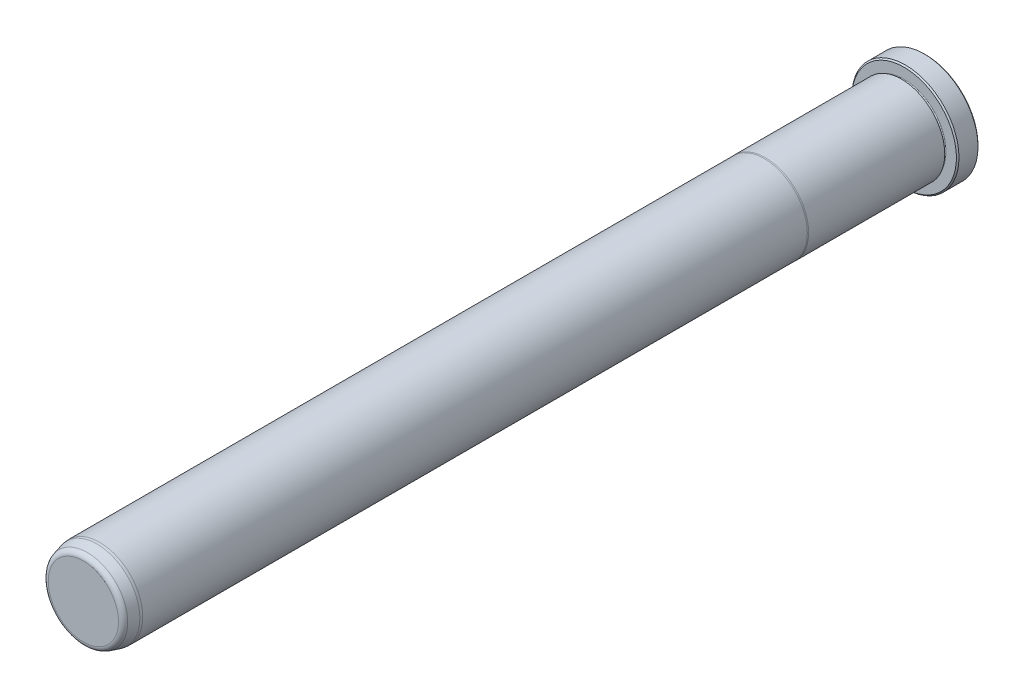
from build123d import *

# Parameters (mm, degrees)
FILLET6_R     = 1.5875
CHAMFER1_SIZE = 0.381


with BuildPart() as part:
    # Sketch1 → Revolve1 (revolve)
    with BuildSketch(Plane(origin=(0, 0, 0), x_dir=(0, 0, -1), z_dir=(1, 0, 0)), mode=Mode.PRIVATE) as revolve1_sk:
        with BuildLine():
            Line((0, 0), (0, 15.748))
            Line((0, 15.748), (-6.35, 15.748))
            Line((-6.35, 15.748), (-6.35, 12.3063))
            ThreePointArc((-6.35, 12.3063), (-6.731, 11.9253), (-7.112, 12.3063))
            Line((-7.112, 12.3063), (-7.112, 12.7127))
            Line((-7.112, 12.7127), (-47.134763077, 12.7127))
            Line((-47.134763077, 12.7127), (-47.498, 12.6873))
            Line((-47.498, 12.6873), (-242.8875, 12.6873))
            Line((-242.8875, 12.6873), (-243.6495, 12.620633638))
            Line((-243.6495, 12.620633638), (-247.65, 11.548702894))
            Line((-247.65, 11.548702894), (-247.65, 0))
            Line((-247.65, 0), (0, 0))
        make_face()
    revolve(revolve1_sk.sketch.rotate(Axis((0, 0, 0), (0, 0, -1)), 90), axis=Axis((0, 0, 0), (0, 0, -1)))

    # Fillet6
    fillet6_edges = [part.edges().sort_by_distance(p)[0] for p in [
        (-11.548702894, 0, 247.65),
    ]]
    fillet(fillet6_edges, radius=FILLET6_R)

    # Chamfer1
    chamfer1_edges = [part.edges().sort_by_distance(p)[0] for p in [
        (-15.748, 0, 6.35),
        (-15.748, 0, 0),
    ]]
    chamfer(chamfer1_edges, length=CHAMFER1_SIZE)


solid = part.part
